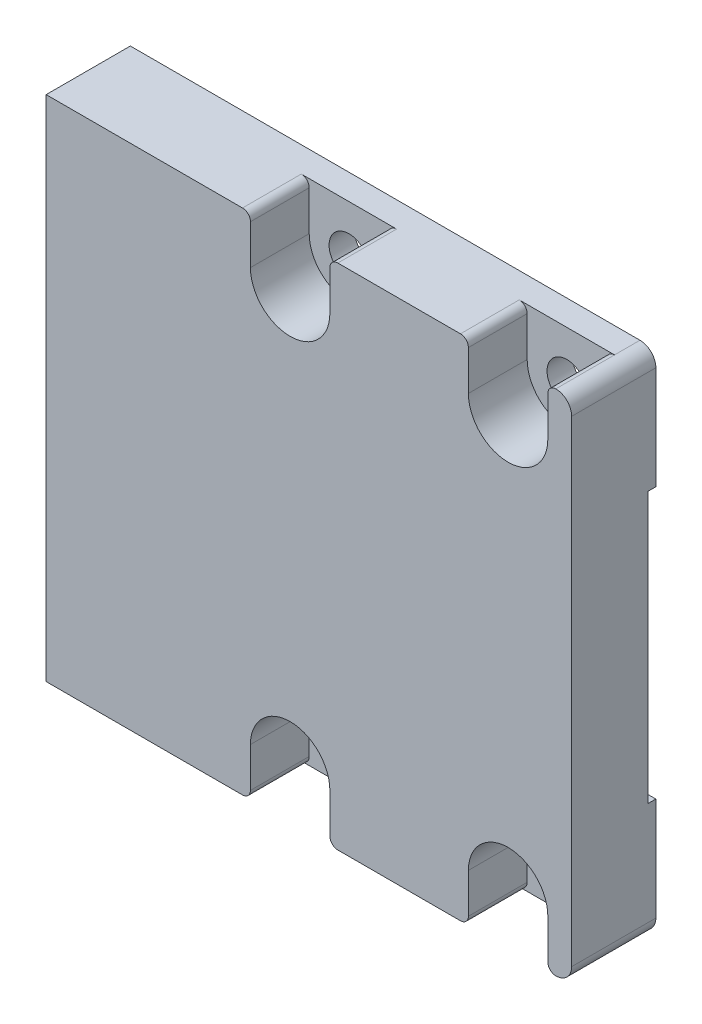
ISO-10303-21;
HEADER;
FILE_DESCRIPTION(('STEP AP214'),'2;1');
FILE_NAME('part.step','',(''),(''),'','','');
FILE_SCHEMA(('AUTOMOTIVE_DESIGN { 1 0 10303 214 1 1 1 1 }'));
ENDSEC;
DATA;
#1=APPLICATION_CONTEXT('core data for automotive mechanical design processes');
#2=APPLICATION_PROTOCOL_DEFINITION('international standard','automotive_design',2000,#1);
#3=PRODUCT_CONTEXT('',#1,'mechanical');
#4=PRODUCT('Part','Part','',(#3));
#5=PRODUCT_RELATED_PRODUCT_CATEGORY('part','',(#4));
#6=PRODUCT_DEFINITION_FORMATION('','',#4);
#7=PRODUCT_DEFINITION_CONTEXT('part definition',#1,'design');
#8=PRODUCT_DEFINITION('design','',#6,#7);
#9=PRODUCT_DEFINITION_SHAPE('','',#8);
#10=(LENGTH_UNIT() NAMED_UNIT(*) SI_UNIT(.MILLI.,.METRE.));
#11=(NAMED_UNIT(*) PLANE_ANGLE_UNIT() SI_UNIT($,.RADIAN.));
#12=(NAMED_UNIT(*) SI_UNIT($,.STERADIAN.) SOLID_ANGLE_UNIT());
#13=UNCERTAINTY_MEASURE_WITH_UNIT(LENGTH_MEASURE(1.E-05),#10,'distance_accuracy_value','');
#14=(GEOMETRIC_REPRESENTATION_CONTEXT(3) GLOBAL_UNCERTAINTY_ASSIGNED_CONTEXT((#13)) GLOBAL_UNIT_ASSIGNED_CONTEXT((#10,
#11,#12)) REPRESENTATION_CONTEXT('',''));
#15=CARTESIAN_POINT('',(0.,0.,0.));
#16=DIRECTION('',(0.,0.,1.));
#17=DIRECTION('',(1.,0.,0.));
#18=AXIS2_PLACEMENT_3D('',#15,#16,#17);
#19=CARTESIAN_POINT('',(23.4813134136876,4.80412632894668,51.5248454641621));
#20=DIRECTION('',(0.,0.,-1.));
#21=DIRECTION('',(-1.,0.,0.));
#22=AXIS2_PLACEMENT_3D('',#19,#20,#21);
#23=CYLINDRICAL_SURFACE('',#22,1.25);
#24=CARTESIAN_POINT('',(23.4813134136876,4.80412632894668,0.));
#25=DIRECTION('',(0.,0.,1.));
#26=DIRECTION('',(1.,0.,0.));
#27=AXIS2_PLACEMENT_3D('',#24,#25,#26);
#28=CIRCLE('',#27,1.25);
#29=CARTESIAN_POINT('',(24.7313134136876,4.80412632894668,0.));
#30=VERTEX_POINT('',#29);
#31=EDGE_CURVE('E405',#30,#30,#28,.T.);
#32=ORIENTED_EDGE('',*,*,#31,.F.);
#33=EDGE_LOOP('',(#32));
#34=FACE_BOUND('',#33,.T.);
#35=CARTESIAN_POINT('',(23.4813134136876,4.80412632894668,1.6));
#36=DIRECTION('',(0.,0.,1.));
#37=DIRECTION('',(1.,0.,0.));
#38=AXIS2_PLACEMENT_3D('',#35,#36,#37);
#39=CIRCLE('',#38,1.25);
#40=CARTESIAN_POINT('',(24.7313134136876,4.80412632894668,1.6));
#41=VERTEX_POINT('',#40);
#42=EDGE_CURVE('E356',#41,#41,#39,.T.);
#43=ORIENTED_EDGE('',*,*,#42,.T.);
#44=EDGE_LOOP('',(#43));
#45=FACE_BOUND('',#44,.T.);
#46=ADVANCED_FACE('F40',(#34,#45),#23,.F.);
#47=CARTESIAN_POINT('',(37.2013134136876,30.8041263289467,51.5248454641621));
#48=DIRECTION('',(0.,0.,-1.));
#49=DIRECTION('',(-1.,0.,0.));
#50=AXIS2_PLACEMENT_3D('',#47,#48,#49);
#51=CYLINDRICAL_SURFACE('',#50,1.25);
#52=CARTESIAN_POINT('',(37.2013134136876,30.8041263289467,0.));
#53=DIRECTION('',(0.,0.,1.));
#54=DIRECTION('',(1.,0.,0.));
#55=AXIS2_PLACEMENT_3D('',#52,#53,#54);
#56=CIRCLE('',#55,1.25);
#57=CARTESIAN_POINT('',(38.4513134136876,30.8041263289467,0.));
#58=VERTEX_POINT('',#57);
#59=EDGE_CURVE('E402',#58,#58,#56,.T.);
#60=ORIENTED_EDGE('',*,*,#59,.F.);
#61=EDGE_LOOP('',(#60));
#62=FACE_BOUND('',#61,.T.);
#63=CARTESIAN_POINT('',(37.2013134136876,30.8041263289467,1.6));
#64=DIRECTION('',(0.,0.,1.));
#65=DIRECTION('',(1.,0.,0.));
#66=AXIS2_PLACEMENT_3D('',#63,#64,#65);
#67=CIRCLE('',#66,1.25);
#68=CARTESIAN_POINT('',(38.4513134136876,30.8041263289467,1.6));
#69=VERTEX_POINT('',#68);
#70=EDGE_CURVE('E362',#69,#69,#67,.T.);
#71=ORIENTED_EDGE('',*,*,#70,.T.);
#72=EDGE_LOOP('',(#71));
#73=FACE_BOUND('',#72,.T.);
#74=ADVANCED_FACE('F583',(#62,#73),#51,.F.);
#75=CARTESIAN_POINT('',(37.2013134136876,4.80412632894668,51.5248454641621));
#76=DIRECTION('',(0.,0.,-1.));
#77=DIRECTION('',(-1.,0.,0.));
#78=AXIS2_PLACEMENT_3D('',#75,#76,#77);
#79=CYLINDRICAL_SURFACE('',#78,1.25);
#80=CARTESIAN_POINT('',(37.2013134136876,4.80412632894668,0.));
#81=DIRECTION('',(0.,0.,1.));
#82=DIRECTION('',(1.,0.,0.));
#83=AXIS2_PLACEMENT_3D('',#80,#81,#82);
#84=CIRCLE('',#83,1.25);
#85=CARTESIAN_POINT('',(38.4513134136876,4.80412632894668,0.));
#86=VERTEX_POINT('',#85);
#87=EDGE_CURVE('E399',#86,#86,#84,.T.);
#88=ORIENTED_EDGE('',*,*,#87,.F.);
#89=EDGE_LOOP('',(#88));
#90=FACE_BOUND('',#89,.T.);
#91=CARTESIAN_POINT('',(37.2013134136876,4.80412632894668,1.6));
#92=DIRECTION('',(0.,0.,1.));
#93=DIRECTION('',(1.,0.,0.));
#94=AXIS2_PLACEMENT_3D('',#91,#92,#93);
#95=CIRCLE('',#94,1.25);
#96=CARTESIAN_POINT('',(38.4513134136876,4.80412632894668,1.6));
#97=VERTEX_POINT('',#96);
#98=EDGE_CURVE('E359',#97,#97,#95,.T.);
#99=ORIENTED_EDGE('',*,*,#98,.T.);
#100=EDGE_LOOP('',(#99));
#101=FACE_BOUND('',#100,.T.);
#102=ADVANCED_FACE('F589',(#90,#101),#79,.F.);
#103=CARTESIAN_POINT('',(23.4813134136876,30.8041263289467,51.5248454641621));
#104=DIRECTION('',(0.,0.,-1.));
#105=DIRECTION('',(-1.,0.,0.));
#106=AXIS2_PLACEMENT_3D('',#103,#104,#105);
#107=CYLINDRICAL_SURFACE('',#106,1.25);
#108=CARTESIAN_POINT('',(23.4813134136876,30.8041263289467,0.));
#109=DIRECTION('',(0.,0.,1.));
#110=DIRECTION('',(1.,0.,0.));
#111=AXIS2_PLACEMENT_3D('',#108,#109,#110);
#112=CIRCLE('',#111,1.25);
#113=CARTESIAN_POINT('',(24.7313134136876,30.8041263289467,0.));
#114=VERTEX_POINT('',#113);
#115=EDGE_CURVE('E396',#114,#114,#112,.T.);
#116=ORIENTED_EDGE('',*,*,#115,.F.);
#117=EDGE_LOOP('',(#116));
#118=FACE_BOUND('',#117,.T.);
#119=CARTESIAN_POINT('',(23.4813134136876,30.8041263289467,1.6));
#120=DIRECTION('',(0.,0.,1.));
#121=DIRECTION('',(1.,0.,0.));
#122=AXIS2_PLACEMENT_3D('',#119,#120,#121);
#123=CIRCLE('',#122,1.25);
#124=CARTESIAN_POINT('',(24.7313134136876,30.8041263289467,1.6));
#125=VERTEX_POINT('',#124);
#126=EDGE_CURVE('E365',#125,#125,#123,.T.);
#127=ORIENTED_EDGE('',*,*,#126,.T.);
#128=EDGE_LOOP('',(#127));
#129=FACE_BOUND('',#128,.T.);
#130=ADVANCED_FACE('F599',(#118,#129),#107,.F.);
#131=CARTESIAN_POINT('',(0.,0.,0.));
#132=DIRECTION('',(0.,0.,1.));
#133=DIRECTION('',(1.,0.,0.));
#134=AXIS2_PLACEMENT_3D('',#131,#132,#133);
#135=PLANE('',#134);
#136=ORIENTED_EDGE('',*,*,#115,.T.);
#137=EDGE_LOOP('',(#136));
#138=FACE_BOUND('',#137,.T.);
#139=ORIENTED_EDGE('',*,*,#87,.T.);
#140=EDGE_LOOP('',(#139));
#141=FACE_BOUND('',#140,.T.);
#142=ORIENTED_EDGE('',*,*,#59,.T.);
#143=EDGE_LOOP('',(#142));
#144=FACE_BOUND('',#143,.T.);
#145=ORIENTED_EDGE('',*,*,#31,.T.);
#146=EDGE_LOOP('',(#145));
#147=FACE_BOUND('',#146,.T.);
#148=DIRECTION('',(1.,0.,0.));
#149=VECTOR('',#148,1.);
#150=CARTESIAN_POINT('',(41.2013134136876,26.3141263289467,0.));
#151=LINE('',#150,#149);
#152=CARTESIAN_POINT('',(30.7013134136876,26.3141263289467,0.));
#153=VERTEX_POINT('',#152);
#154=CARTESIAN_POINT('',(41.2013134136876,26.3141263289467,0.));
#155=VERTEX_POINT('',#154);
#156=EDGE_CURVE('E56',#153,#155,#151,.T.);
#157=ORIENTED_EDGE('',*,*,#156,.F.);
#158=DIRECTION('',(0.,-1.,0.));
#159=VECTOR('',#158,1.);
#160=CARTESIAN_POINT('',(30.7013134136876,0.,0.));
#161=LINE('',#160,#159);
#162=CARTESIAN_POINT('',(30.7013134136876,9.29412632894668,0.));
#163=VERTEX_POINT('',#162);
#164=EDGE_CURVE('E522',#153,#163,#161,.T.);
#165=ORIENTED_EDGE('',*,*,#164,.T.);
#166=DIRECTION('',(-1.,0.,0.));
#167=VECTOR('',#166,1.);
#168=CARTESIAN_POINT('',(41.2013134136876,9.29412632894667,0.));
#169=LINE('',#168,#167);
#170=CARTESIAN_POINT('',(41.2013134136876,9.29412632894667,0.));
#171=VERTEX_POINT('',#170);
#172=EDGE_CURVE('E63',#171,#163,#169,.T.);
#173=ORIENTED_EDGE('',*,*,#172,.F.);
#174=DIRECTION('',(0.,-1.,0.));
#175=VECTOR('',#174,1.);
#176=CARTESIAN_POINT('',(41.2013134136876,0.,0.));
#177=LINE('',#176,#175);
#178=CARTESIAN_POINT('',(41.2013134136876,2.80412632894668,0.));
#179=VERTEX_POINT('',#178);
#180=EDGE_CURVE('E413',#171,#179,#177,.T.);
#181=ORIENTED_EDGE('',*,*,#180,.T.);
#182=CARTESIAN_POINT('',(40.2013134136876,2.80412632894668,0.));
#183=DIRECTION('',(0.,0.,1.));
#184=DIRECTION('',(1.,0.,0.));
#185=AXIS2_PLACEMENT_3D('',#182,#183,#184);
#186=CIRCLE('',#185,1.);
#187=CARTESIAN_POINT('',(40.2013134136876,1.80412632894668,0.));
#188=VERTEX_POINT('',#187);
#189=EDGE_CURVE('E432',#179,#188,#186,.F.);
#190=ORIENTED_EDGE('',*,*,#189,.T.);
#191=DIRECTION('',(-1.,0.,0.));
#192=VECTOR('',#191,1.);
#193=CARTESIAN_POINT('',(0.,1.80412632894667,0.));
#194=LINE('',#193,#192);
#195=CARTESIAN_POINT('',(8.12131341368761,1.80412632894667,0.));
#196=VERTEX_POINT('',#195);
#197=EDGE_CURVE('E411',#188,#196,#194,.T.);
#198=ORIENTED_EDGE('',*,*,#197,.T.);
#199=DIRECTION('',(0.,1.,0.));
#200=VECTOR('',#199,1.);
#201=CARTESIAN_POINT('',(8.12131341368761,0.,0.));
#202=LINE('',#201,#200);
#203=CARTESIAN_POINT('',(8.12131341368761,33.8041263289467,0.));
#204=VERTEX_POINT('',#203);
#205=EDGE_CURVE('E408',#196,#204,#202,.T.);
#206=ORIENTED_EDGE('',*,*,#205,.T.);
#207=DIRECTION('',(1.,0.,0.));
#208=VECTOR('',#207,1.);
#209=CARTESIAN_POINT('',(0.,33.8041263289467,0.));
#210=LINE('',#209,#208);
#211=CARTESIAN_POINT('',(40.2013134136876,33.8041263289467,0.));
#212=VERTEX_POINT('',#211);
#213=EDGE_CURVE('E416',#204,#212,#210,.T.);
#214=ORIENTED_EDGE('',*,*,#213,.T.);
#215=CARTESIAN_POINT('',(40.2013134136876,32.8041263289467,0.));
#216=DIRECTION('',(0.,0.,1.));
#217=DIRECTION('',(1.,0.,0.));
#218=AXIS2_PLACEMENT_3D('',#215,#216,#217);
#219=CIRCLE('',#218,1.);
#220=CARTESIAN_POINT('',(41.2013134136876,32.8041263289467,0.));
#221=VERTEX_POINT('',#220);
#222=EDGE_CURVE('E434',#212,#221,#219,.F.);
#223=ORIENTED_EDGE('',*,*,#222,.T.);
#224=EDGE_CURVE('E414',#221,#155,#177,.T.);
#225=ORIENTED_EDGE('',*,*,#224,.T.);
#226=EDGE_LOOP('',(#157,#165,#173,#181,#190,#198,#206,#214,#223,#225));
#227=FACE_BOUND('',#226,.T.);
#228=ADVANCED_FACE('F531',(#138,#141,#144,#147,#227),#135,.F.);
#229=CARTESIAN_POINT('',(0.,33.8041263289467,51.5248454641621));
#230=DIRECTION('',(0.,1.,0.));
#231=DIRECTION('',(-1.,0.,0.));
#232=AXIS2_PLACEMENT_3D('',#229,#230,#231);
#233=PLANE('',#232);
#234=DIRECTION('',(1.,0.,0.));
#235=VECTOR('',#234,1.);
#236=CARTESIAN_POINT('',(0.,33.8041263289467,5.3));
#237=LINE('',#236,#235);
#238=CARTESIAN_POINT('',(26.4813134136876,33.8041263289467,5.3));
#239=VERTEX_POINT('',#238);
#240=CARTESIAN_POINT('',(34.2013134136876,33.8041263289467,5.3));
#241=VERTEX_POINT('',#240);
#242=EDGE_CURVE('E424',#239,#241,#237,.T.);
#243=ORIENTED_EDGE('',*,*,#242,.T.);
#244=DIRECTION('',(0.,0.,1.));
#245=VECTOR('',#244,1.);
#246=CARTESIAN_POINT('',(34.2013134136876,33.8041263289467,1.6));
#247=LINE('',#246,#245);
#248=CARTESIAN_POINT('',(34.2013134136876,33.8041263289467,1.6));
#249=VERTEX_POINT('',#248);
#250=EDGE_CURVE('E475',#241,#249,#247,.F.);
#251=ORIENTED_EDGE('',*,*,#250,.T.);
#252=DIRECTION('',(1.,0.,0.));
#253=VECTOR('',#252,1.);
#254=CARTESIAN_POINT('',(39.7013134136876,33.8041263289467,1.6));
#255=LINE('',#254,#253);
#256=CARTESIAN_POINT('',(40.2013134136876,33.8041263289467,1.6));
#257=VERTEX_POINT('',#256);
#258=EDGE_CURVE('E294',#249,#257,#255,.T.);
#259=ORIENTED_EDGE('',*,*,#258,.T.);
#260=DIRECTION('',(0.,0.,-1.));
#261=VECTOR('',#260,1.);
#262=CARTESIAN_POINT('',(40.2013134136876,33.8041263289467,51.5248454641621));
#263=LINE('',#262,#261);
#264=EDGE_CURVE('E428',#257,#212,#263,.T.);
#265=ORIENTED_EDGE('',*,*,#264,.T.);
#266=ORIENTED_EDGE('',*,*,#213,.F.);
#267=DIRECTION('',(0.,0.,-1.));
#268=VECTOR('',#267,1.);
#269=CARTESIAN_POINT('',(8.12131341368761,33.8041263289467,51.5248454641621));
#270=LINE('',#269,#268);
#271=CARTESIAN_POINT('',(8.12131341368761,33.8041263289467,5.3));
#272=VERTEX_POINT('',#271);
#273=EDGE_CURVE('E419',#272,#204,#270,.T.);
#274=ORIENTED_EDGE('',*,*,#273,.F.);
#275=CARTESIAN_POINT('',(20.4813134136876,33.8041263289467,5.3));
#276=VERTEX_POINT('',#275);
#277=EDGE_CURVE('E425',#272,#276,#237,.T.);
#278=ORIENTED_EDGE('',*,*,#277,.T.);
#279=DIRECTION('',(0.,0.,1.));
#280=VECTOR('',#279,1.);
#281=CARTESIAN_POINT('',(20.4813134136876,33.8041263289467,1.6));
#282=LINE('',#281,#280);
#283=CARTESIAN_POINT('',(20.4813134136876,33.8041263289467,1.6));
#284=VERTEX_POINT('',#283);
#285=EDGE_CURVE('E472',#276,#284,#282,.F.);
#286=ORIENTED_EDGE('',*,*,#285,.T.);
#287=DIRECTION('',(1.,0.,0.));
#288=VECTOR('',#287,1.);
#289=CARTESIAN_POINT('',(25.9813134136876,33.8041263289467,1.6));
#290=LINE('',#289,#288);
#291=CARTESIAN_POINT('',(26.4813134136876,33.8041263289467,1.6));
#292=VERTEX_POINT('',#291);
#293=EDGE_CURVE('E319',#284,#292,#290,.T.);
#294=ORIENTED_EDGE('',*,*,#293,.T.);
#295=DIRECTION('',(0.,0.,1.));
#296=VECTOR('',#295,1.);
#297=CARTESIAN_POINT('',(26.4813134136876,33.8041263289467,5.3));
#298=LINE('',#297,#296);
#299=EDGE_CURVE('E469',#292,#239,#298,.T.);
#300=ORIENTED_EDGE('',*,*,#299,.T.);
#301=EDGE_LOOP('',(#243,#251,#259,#265,#266,#274,#278,#286,#294,#300));
#302=FACE_BOUND('',#301,.T.);
#303=ADVANCED_FACE('F560',(#302),#233,.T.);
#304=CARTESIAN_POINT('',(41.2013134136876,0.,51.5248454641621));
#305=DIRECTION('',(1.,0.,0.));
#306=DIRECTION('',(0.,1.,0.));
#307=AXIS2_PLACEMENT_3D('',#304,#305,#306);
#308=PLANE('',#307);
#309=DIRECTION('',(0.,0.,-1.));
#310=VECTOR('',#309,1.);
#311=CARTESIAN_POINT('',(41.2013134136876,26.3141263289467,0.5));
#312=LINE('',#311,#310);
#313=CARTESIAN_POINT('',(41.2013134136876,26.3141263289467,0.5));
#314=VERTEX_POINT('',#313);
#315=EDGE_CURVE('E382',#314,#155,#312,.T.);
#316=ORIENTED_EDGE('',*,*,#315,.T.);
#317=ORIENTED_EDGE('',*,*,#224,.F.);
#318=DIRECTION('',(0.,0.,-1.));
#319=VECTOR('',#318,1.);
#320=CARTESIAN_POINT('',(41.2013134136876,32.8041263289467,51.5248454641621));
#321=LINE('',#320,#319);
#322=CARTESIAN_POINT('',(41.2013134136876,32.8041263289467,5.3));
#323=VERTEX_POINT('',#322);
#324=EDGE_CURVE('E439',#221,#323,#321,.F.);
#325=ORIENTED_EDGE('',*,*,#324,.T.);
#326=DIRECTION('',(0.,-1.,0.));
#327=VECTOR('',#326,1.);
#328=CARTESIAN_POINT('',(41.2013134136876,0.,5.3));
#329=LINE('',#328,#327);
#330=CARTESIAN_POINT('',(41.2013134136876,2.80412632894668,5.3));
#331=VERTEX_POINT('',#330);
#332=EDGE_CURVE('E385',#323,#331,#329,.T.);
#333=ORIENTED_EDGE('',*,*,#332,.T.);
#334=DIRECTION('',(0.,0.,-1.));
#335=VECTOR('',#334,1.);
#336=CARTESIAN_POINT('',(41.2013134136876,2.80412632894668,51.5248454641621));
#337=LINE('',#336,#335);
#338=EDGE_CURVE('E436',#331,#179,#337,.T.);
#339=ORIENTED_EDGE('',*,*,#338,.T.);
#340=ORIENTED_EDGE('',*,*,#180,.F.);
#341=DIRECTION('',(0.,0.,-1.));
#342=VECTOR('',#341,1.);
#343=CARTESIAN_POINT('',(41.2013134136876,9.29412632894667,0.5));
#344=LINE('',#343,#342);
#345=CARTESIAN_POINT('',(41.2013134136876,9.29412632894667,0.5));
#346=VERTEX_POINT('',#345);
#347=EDGE_CURVE('E379',#346,#171,#344,.T.);
#348=ORIENTED_EDGE('',*,*,#347,.F.);
#349=DIRECTION('',(0.,-1.,0.));
#350=VECTOR('',#349,1.);
#351=CARTESIAN_POINT('',(41.2013134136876,9.29412632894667,0.5));
#352=LINE('',#351,#350);
#353=EDGE_CURVE('E368',#314,#346,#352,.T.);
#354=ORIENTED_EDGE('',*,*,#353,.F.);
#355=EDGE_LOOP('',(#316,#317,#325,#333,#339,#340,#348,#354));
#356=FACE_BOUND('',#355,.T.);
#357=ADVANCED_FACE('F536',(#356),#308,.T.);
#358=CARTESIAN_POINT('',(0.,1.80412632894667,51.5248454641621));
#359=DIRECTION('',(0.,-1.,0.));
#360=DIRECTION('',(1.,0.,0.));
#361=AXIS2_PLACEMENT_3D('',#358,#359,#360);
#362=PLANE('',#361);
#363=DIRECTION('',(0.,0.,-1.));
#364=VECTOR('',#363,1.);
#365=CARTESIAN_POINT('',(40.2013134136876,1.80412632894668,51.5248454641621));
#366=LINE('',#365,#364);
#367=CARTESIAN_POINT('',(40.2013134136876,1.80412632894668,1.6));
#368=VERTEX_POINT('',#367);
#369=EDGE_CURVE('E447',#188,#368,#366,.F.);
#370=ORIENTED_EDGE('',*,*,#369,.T.);
#371=DIRECTION('',(-1.,0.,0.));
#372=VECTOR('',#371,1.);
#373=CARTESIAN_POINT('',(34.7013134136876,1.80412632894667,1.6));
#374=LINE('',#373,#372);
#375=CARTESIAN_POINT('',(34.2013134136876,1.80412632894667,1.6));
#376=VERTEX_POINT('',#375);
#377=EDGE_CURVE('E276',#368,#376,#374,.T.);
#378=ORIENTED_EDGE('',*,*,#377,.T.);
#379=DIRECTION('',(0.,0.,1.));
#380=VECTOR('',#379,1.);
#381=CARTESIAN_POINT('',(34.2013134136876,1.80412632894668,5.3));
#382=LINE('',#381,#380);
#383=CARTESIAN_POINT('',(34.2013134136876,1.80412632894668,5.3));
#384=VERTEX_POINT('',#383);
#385=EDGE_CURVE('E481',#376,#384,#382,.T.);
#386=ORIENTED_EDGE('',*,*,#385,.T.);
#387=DIRECTION('',(-1.,0.,0.));
#388=VECTOR('',#387,1.);
#389=CARTESIAN_POINT('',(0.,1.80412632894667,5.3));
#390=LINE('',#389,#388);
#391=CARTESIAN_POINT('',(26.4813134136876,1.80412632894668,5.3));
#392=VERTEX_POINT('',#391);
#393=EDGE_CURVE('E390',#384,#392,#390,.T.);
#394=ORIENTED_EDGE('',*,*,#393,.T.);
#395=DIRECTION('',(0.,0.,1.));
#396=VECTOR('',#395,1.);
#397=CARTESIAN_POINT('',(26.4813134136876,1.80412632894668,1.6));
#398=LINE('',#397,#396);
#399=CARTESIAN_POINT('',(26.4813134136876,1.80412632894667,1.6));
#400=VERTEX_POINT('',#399);
#401=EDGE_CURVE('E487',#392,#400,#398,.F.);
#402=ORIENTED_EDGE('',*,*,#401,.T.);
#403=DIRECTION('',(-1.,0.,0.));
#404=VECTOR('',#403,1.);
#405=CARTESIAN_POINT('',(20.9813134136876,1.80412632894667,1.6));
#406=LINE('',#405,#404);
#407=CARTESIAN_POINT('',(20.4813134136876,1.80412632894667,1.6));
#408=VERTEX_POINT('',#407);
#409=EDGE_CURVE('E335',#400,#408,#406,.T.);
#410=ORIENTED_EDGE('',*,*,#409,.T.);
#411=DIRECTION('',(0.,0.,1.));
#412=VECTOR('',#411,1.);
#413=CARTESIAN_POINT('',(20.4813134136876,1.80412632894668,5.3));
#414=LINE('',#413,#412);
#415=CARTESIAN_POINT('',(20.4813134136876,1.80412632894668,5.3));
#416=VERTEX_POINT('',#415);
#417=EDGE_CURVE('E484',#408,#416,#414,.T.);
#418=ORIENTED_EDGE('',*,*,#417,.T.);
#419=CARTESIAN_POINT('',(8.12131341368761,1.80412632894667,5.3));
#420=VERTEX_POINT('',#419);
#421=EDGE_CURVE('E389',#416,#420,#390,.T.);
#422=ORIENTED_EDGE('',*,*,#421,.T.);
#423=DIRECTION('',(0.,0.,-1.));
#424=VECTOR('',#423,1.);
#425=CARTESIAN_POINT('',(8.12131341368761,1.80412632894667,51.5248454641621));
#426=LINE('',#425,#424);
#427=EDGE_CURVE('E421',#420,#196,#426,.T.);
#428=ORIENTED_EDGE('',*,*,#427,.T.);
#429=ORIENTED_EDGE('',*,*,#197,.F.);
#430=EDGE_LOOP('',(#370,#378,#386,#394,#402,#410,#418,#422,#428,#429));
#431=FACE_BOUND('',#430,.T.);
#432=ADVANCED_FACE('F548',(#431),#362,.T.);
#433=CARTESIAN_POINT('',(8.12131341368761,0.,51.5248454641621));
#434=DIRECTION('',(-1.,0.,0.));
#435=DIRECTION('',(0.,0.,1.));
#436=AXIS2_PLACEMENT_3D('',#433,#434,#435);
#437=PLANE('',#436);
#438=ORIENTED_EDGE('',*,*,#427,.F.);
#439=DIRECTION('',(0.,1.,0.));
#440=VECTOR('',#439,1.);
#441=CARTESIAN_POINT('',(8.12131341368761,0.,5.3));
#442=LINE('',#441,#440);
#443=EDGE_CURVE('E393',#420,#272,#442,.T.);
#444=ORIENTED_EDGE('',*,*,#443,.T.);
#445=ORIENTED_EDGE('',*,*,#273,.T.);
#446=ORIENTED_EDGE('',*,*,#205,.F.);
#447=EDGE_LOOP('',(#438,#444,#445,#446));
#448=FACE_BOUND('',#447,.T.);
#449=ADVANCED_FACE('F555',(#448),#437,.T.);
#450=CARTESIAN_POINT('',(-8.51868658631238,17.8041263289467,5.3));
#451=DIRECTION('',(0.,0.,1.));
#452=DIRECTION('',(1.,0.,0.));
#453=AXIS2_PLACEMENT_3D('',#450,#451,#452);
#454=PLANE('',#453);
#455=DIRECTION('',(0.,-1.,0.));
#456=VECTOR('',#455,1.);
#457=CARTESIAN_POINT('',(34.7013134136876,33.8041263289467,5.3));
#458=LINE('',#457,#456);
#459=CARTESIAN_POINT('',(34.7013134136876,33.3041263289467,5.3));
#460=VERTEX_POINT('',#459);
#461=CARTESIAN_POINT('',(34.7013134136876,30.8041263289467,5.3));
#462=VERTEX_POINT('',#461);
#463=EDGE_CURVE('E307',#460,#462,#458,.T.);
#464=ORIENTED_EDGE('',*,*,#463,.F.);
#465=CARTESIAN_POINT('',(34.2013134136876,33.3041263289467,5.3));
#466=DIRECTION('',(0.,0.,1.));
#467=DIRECTION('',(1.,0.,0.));
#468=AXIS2_PLACEMENT_3D('',#465,#466,#467);
#469=CIRCLE('',#468,0.5);
#470=EDGE_CURVE('E467',#460,#241,#469,.T.);
#471=ORIENTED_EDGE('',*,*,#470,.T.);
#472=ORIENTED_EDGE('',*,*,#242,.F.);
#473=CARTESIAN_POINT('',(26.4813134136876,33.3041263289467,5.3));
#474=DIRECTION('',(0.,0.,1.));
#475=DIRECTION('',(1.,0.,0.));
#476=AXIS2_PLACEMENT_3D('',#473,#474,#475);
#477=CIRCLE('',#476,0.5);
#478=CARTESIAN_POINT('',(25.9813134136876,33.3041263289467,5.3));
#479=VERTEX_POINT('',#478);
#480=EDGE_CURVE('E455',#239,#479,#477,.T.);
#481=ORIENTED_EDGE('',*,*,#480,.T.);
#482=DIRECTION('',(0.,1.,0.));
#483=VECTOR('',#482,1.);
#484=CARTESIAN_POINT('',(25.9813134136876,30.8041263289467,5.3));
#485=LINE('',#484,#483);
#486=CARTESIAN_POINT('',(25.9813134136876,30.8041263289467,5.3));
#487=VERTEX_POINT('',#486);
#488=EDGE_CURVE('E326',#487,#479,#485,.T.);
#489=ORIENTED_EDGE('',*,*,#488,.F.);
#490=CARTESIAN_POINT('',(23.4813134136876,30.8041263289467,5.3));
#491=DIRECTION('',(0.,0.,1.));
#492=DIRECTION('',(1.,0.,0.));
#493=AXIS2_PLACEMENT_3D('',#490,#491,#492);
#494=CIRCLE('',#493,2.5);
#495=CARTESIAN_POINT('',(20.9813134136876,30.8041263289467,5.3));
#496=VERTEX_POINT('',#495);
#497=EDGE_CURVE('E323',#496,#487,#494,.T.);
#498=ORIENTED_EDGE('',*,*,#497,.F.);
#499=DIRECTION('',(0.,-1.,0.));
#500=VECTOR('',#499,1.);
#501=CARTESIAN_POINT('',(20.9813134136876,33.8041263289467,5.3));
#502=LINE('',#501,#500);
#503=CARTESIAN_POINT('',(20.9813134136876,33.3041263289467,5.3));
#504=VERTEX_POINT('',#503);
#505=EDGE_CURVE('E321',#504,#496,#502,.T.);
#506=ORIENTED_EDGE('',*,*,#505,.F.);
#507=CARTESIAN_POINT('',(20.4813134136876,33.3041263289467,5.3));
#508=DIRECTION('',(0.,0.,1.));
#509=DIRECTION('',(1.,0.,0.));
#510=AXIS2_PLACEMENT_3D('',#507,#508,#509);
#511=CIRCLE('',#510,0.5);
#512=EDGE_CURVE('E457',#504,#276,#511,.T.);
#513=ORIENTED_EDGE('',*,*,#512,.T.);
#514=ORIENTED_EDGE('',*,*,#277,.F.);
#515=ORIENTED_EDGE('',*,*,#443,.F.);
#516=ORIENTED_EDGE('',*,*,#421,.F.);
#517=CARTESIAN_POINT('',(20.4813134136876,2.30412632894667,5.3));
#518=DIRECTION('',(0.,0.,1.));
#519=DIRECTION('',(1.,0.,0.));
#520=AXIS2_PLACEMENT_3D('',#517,#518,#519);
#521=CIRCLE('',#520,0.5);
#522=CARTESIAN_POINT('',(20.9813134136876,2.30412632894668,5.3));
#523=VERTEX_POINT('',#522);
#524=EDGE_CURVE('E459',#416,#523,#521,.T.);
#525=ORIENTED_EDGE('',*,*,#524,.T.);
#526=DIRECTION('',(0.,-1.,0.));
#527=VECTOR('',#526,1.);
#528=CARTESIAN_POINT('',(20.9813134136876,4.80412632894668,5.3));
#529=LINE('',#528,#527);
#530=CARTESIAN_POINT('',(20.9813134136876,4.80412632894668,5.3));
#531=VERTEX_POINT('',#530);
#532=EDGE_CURVE('E345',#531,#523,#529,.T.);
#533=ORIENTED_EDGE('',*,*,#532,.F.);
#534=CARTESIAN_POINT('',(23.4813134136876,4.80412632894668,5.3));
#535=DIRECTION('',(0.,0.,1.));
#536=DIRECTION('',(1.,0.,0.));
#537=AXIS2_PLACEMENT_3D('',#534,#535,#536);
#538=CIRCLE('',#537,2.5);
#539=CARTESIAN_POINT('',(25.9813134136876,4.80412632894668,5.3));
#540=VERTEX_POINT('',#539);
#541=EDGE_CURVE('E293',#540,#531,#538,.T.);
#542=ORIENTED_EDGE('',*,*,#541,.F.);
#543=DIRECTION('',(0.,1.,0.));
#544=VECTOR('',#543,1.);
#545=CARTESIAN_POINT('',(25.9813134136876,1.80412632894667,5.3));
#546=LINE('',#545,#544);
#547=CARTESIAN_POINT('',(25.9813134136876,2.30412632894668,5.3));
#548=VERTEX_POINT('',#547);
#549=EDGE_CURVE('E348',#548,#540,#546,.T.);
#550=ORIENTED_EDGE('',*,*,#549,.F.);
#551=CARTESIAN_POINT('',(26.4813134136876,2.30412632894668,5.3));
#552=DIRECTION('',(0.,0.,1.));
#553=DIRECTION('',(1.,0.,0.));
#554=AXIS2_PLACEMENT_3D('',#551,#552,#553);
#555=CIRCLE('',#554,0.5);
#556=EDGE_CURVE('E461',#548,#392,#555,.T.);
#557=ORIENTED_EDGE('',*,*,#556,.T.);
#558=ORIENTED_EDGE('',*,*,#393,.F.);
#559=CARTESIAN_POINT('',(34.2013134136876,2.30412632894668,5.3));
#560=DIRECTION('',(0.,0.,1.));
#561=DIRECTION('',(1.,0.,0.));
#562=AXIS2_PLACEMENT_3D('',#559,#560,#561);
#563=CIRCLE('',#562,0.5);
#564=CARTESIAN_POINT('',(34.7013134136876,2.30412632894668,5.3));
#565=VERTEX_POINT('',#564);
#566=EDGE_CURVE('E453',#384,#565,#563,.T.);
#567=ORIENTED_EDGE('',*,*,#566,.T.);
#568=DIRECTION('',(0.,-1.,0.));
#569=VECTOR('',#568,1.);
#570=CARTESIAN_POINT('',(34.7013134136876,4.80412632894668,5.3));
#571=LINE('',#570,#569);
#572=CARTESIAN_POINT('',(34.7013134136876,4.80412632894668,5.3));
#573=VERTEX_POINT('',#572);
#574=EDGE_CURVE('E266',#573,#565,#571,.T.);
#575=ORIENTED_EDGE('',*,*,#574,.F.);
#576=CARTESIAN_POINT('',(37.2013134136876,4.80412632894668,5.3));
#577=DIRECTION('',(0.,0.,1.));
#578=DIRECTION('',(-1.,0.,0.));
#579=AXIS2_PLACEMENT_3D('',#576,#577,#578);
#580=CIRCLE('',#579,2.5);
#581=CARTESIAN_POINT('',(39.7013134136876,4.80412632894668,5.3));
#582=VERTEX_POINT('',#581);
#583=EDGE_CURVE('E271',#582,#573,#580,.T.);
#584=ORIENTED_EDGE('',*,*,#583,.F.);
#585=DIRECTION('',(0.,1.,0.));
#586=VECTOR('',#585,1.);
#587=CARTESIAN_POINT('',(39.7013134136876,1.80412632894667,5.3));
#588=LINE('',#587,#586);
#589=CARTESIAN_POINT('',(39.7013134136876,2.30412632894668,5.3));
#590=VERTEX_POINT('',#589);
#591=EDGE_CURVE('E256',#590,#582,#588,.T.);
#592=ORIENTED_EDGE('',*,*,#591,.F.);
#593=CARTESIAN_POINT('',(40.2013134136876,2.30412632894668,5.3));
#594=DIRECTION('',(0.,0.,1.));
#595=DIRECTION('',(1.,0.,0.));
#596=AXIS2_PLACEMENT_3D('',#593,#594,#595);
#597=CIRCLE('',#596,0.5);
#598=CARTESIAN_POINT('',(40.2013134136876,1.80412632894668,5.3));
#599=VERTEX_POINT('',#598);
#600=EDGE_CURVE('E463',#590,#599,#597,.T.);
#601=ORIENTED_EDGE('',*,*,#600,.T.);
#602=CARTESIAN_POINT('',(40.2013134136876,2.80412632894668,5.3));
#603=DIRECTION('',(0.,0.,1.));
#604=DIRECTION('',(1.,0.,0.));
#605=AXIS2_PLACEMENT_3D('',#602,#603,#604);
#606=CIRCLE('',#605,1.);
#607=EDGE_CURVE('E441',#599,#331,#606,.T.);
#608=ORIENTED_EDGE('',*,*,#607,.T.);
#609=ORIENTED_EDGE('',*,*,#332,.F.);
#610=CARTESIAN_POINT('',(40.2013134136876,32.8041263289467,5.3));
#611=DIRECTION('',(0.,0.,1.));
#612=DIRECTION('',(1.,0.,0.));
#613=AXIS2_PLACEMENT_3D('',#610,#611,#612);
#614=CIRCLE('',#613,1.);
#615=CARTESIAN_POINT('',(40.2013134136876,33.8041263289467,5.3));
#616=VERTEX_POINT('',#615);
#617=EDGE_CURVE('E443',#323,#616,#614,.T.);
#618=ORIENTED_EDGE('',*,*,#617,.T.);
#619=CARTESIAN_POINT('',(40.2013134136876,33.3041263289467,5.3));
#620=DIRECTION('',(0.,0.,1.));
#621=DIRECTION('',(1.,0.,0.));
#622=AXIS2_PLACEMENT_3D('',#619,#620,#621);
#623=CIRCLE('',#622,0.5);
#624=CARTESIAN_POINT('',(39.7013134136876,33.3041263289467,5.3));
#625=VERTEX_POINT('',#624);
#626=EDGE_CURVE('E465',#616,#625,#623,.T.);
#627=ORIENTED_EDGE('',*,*,#626,.T.);
#628=DIRECTION('',(0.,1.,0.));
#629=VECTOR('',#628,1.);
#630=CARTESIAN_POINT('',(39.7013134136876,30.8041263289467,5.3));
#631=LINE('',#630,#629);
#632=CARTESIAN_POINT('',(39.7013134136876,30.8041263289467,5.3));
#633=VERTEX_POINT('',#632);
#634=EDGE_CURVE('E303',#633,#625,#631,.T.);
#635=ORIENTED_EDGE('',*,*,#634,.F.);
#636=CARTESIAN_POINT('',(37.2013134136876,30.8041263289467,5.3));
#637=DIRECTION('',(0.,0.,1.));
#638=DIRECTION('',(1.,0.,0.));
#639=AXIS2_PLACEMENT_3D('',#636,#637,#638);
#640=CIRCLE('',#639,2.5);
#641=EDGE_CURVE('E301',#462,#633,#640,.T.);
#642=ORIENTED_EDGE('',*,*,#641,.F.);
#643=EDGE_LOOP('',(#464,#471,#472,#481,#489,#498,#506,#513,#514,#515,#516,#525,#533,#542,#550,
#557,#558,#567,#575,#584,#592,#601,#608,#609,#618,#627,#635,#642));
#644=FACE_BOUND('',#643,.T.);
#645=ADVANCED_FACE('F280',(#644),#454,.T.);
#646=CARTESIAN_POINT('',(40.2013134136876,32.8041263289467,51.5248454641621));
#647=DIRECTION('',(0.,0.,-1.));
#648=DIRECTION('',(-1.,0.,0.));
#649=AXIS2_PLACEMENT_3D('',#646,#647,#648);
#650=CYLINDRICAL_SURFACE('',#649,1.);
#651=ORIENTED_EDGE('',*,*,#617,.F.);
#652=ORIENTED_EDGE('',*,*,#324,.F.);
#653=ORIENTED_EDGE('',*,*,#222,.F.);
#654=ORIENTED_EDGE('',*,*,#264,.F.);
#655=EDGE_CURVE('E429',#616,#257,#263,.T.);
#656=ORIENTED_EDGE('',*,*,#655,.F.);
#657=EDGE_LOOP('',(#651,#652,#653,#654,#656));
#658=FACE_BOUND('',#657,.T.);
#659=ADVANCED_FACE('F567',(#658),#650,.T.);
#660=CARTESIAN_POINT('',(40.2013134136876,2.80412632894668,51.5248454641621));
#661=DIRECTION('',(0.,0.,-1.));
#662=DIRECTION('',(-1.,0.,0.));
#663=AXIS2_PLACEMENT_3D('',#660,#661,#662);
#664=CYLINDRICAL_SURFACE('',#663,1.);
#665=ORIENTED_EDGE('',*,*,#607,.F.);
#666=EDGE_CURVE('E446',#368,#599,#366,.F.);
#667=ORIENTED_EDGE('',*,*,#666,.F.);
#668=ORIENTED_EDGE('',*,*,#369,.F.);
#669=ORIENTED_EDGE('',*,*,#189,.F.);
#670=ORIENTED_EDGE('',*,*,#338,.F.);
#671=EDGE_LOOP('',(#665,#667,#668,#669,#670));
#672=FACE_BOUND('',#671,.T.);
#673=ADVANCED_FACE('F542',(#672),#664,.T.);
#674=CARTESIAN_POINT('',(41.2013134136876,26.3141263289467,0.5));
#675=DIRECTION('',(0.,1.,0.));
#676=DIRECTION('',(-1.,0.,0.));
#677=AXIS2_PLACEMENT_3D('',#674,#675,#676);
#678=PLANE('',#677);
#679=ORIENTED_EDGE('',*,*,#156,.T.);
#680=ORIENTED_EDGE('',*,*,#315,.F.);
#681=DIRECTION('',(1.,0.,0.));
#682=VECTOR('',#681,1.);
#683=CARTESIAN_POINT('',(41.2013134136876,26.3141263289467,0.5));
#684=LINE('',#683,#682);
#685=CARTESIAN_POINT('',(31.2013134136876,26.3141263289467,0.5));
#686=VERTEX_POINT('',#685);
#687=EDGE_CURVE('E377',#686,#314,#684,.T.);
#688=ORIENTED_EDGE('',*,*,#687,.F.);
#689=DIRECTION('',(0.707106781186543,0.,0.707106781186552));
#690=VECTOR('',#689,1.);
#691=CARTESIAN_POINT('',(36.2013134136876,26.3141263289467,5.5));
#692=LINE('',#691,#690);
#693=EDGE_CURVE('E49',#686,#153,#692,.F.);
#694=ORIENTED_EDGE('',*,*,#693,.T.);
#695=EDGE_LOOP('',(#679,#680,#688,#694));
#696=FACE_BOUND('',#695,.T.);
#697=ADVANCED_FACE('F526',(#696),#678,.F.);
#698=CARTESIAN_POINT('',(41.2013134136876,9.29412632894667,0.5));
#699=DIRECTION('',(0.,-1.,0.));
#700=DIRECTION('',(1.,0.,0.));
#701=AXIS2_PLACEMENT_3D('',#698,#699,#700);
#702=PLANE('',#701);
#703=ORIENTED_EDGE('',*,*,#172,.T.);
#704=DIRECTION('',(-0.707106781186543,0.,-0.707106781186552));
#705=VECTOR('',#704,1.);
#706=CARTESIAN_POINT('',(36.2013134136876,9.29412632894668,5.5));
#707=LINE('',#706,#705);
#708=CARTESIAN_POINT('',(31.2013134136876,9.29412632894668,0.5));
#709=VERTEX_POINT('',#708);
#710=EDGE_CURVE('E12',#163,#709,#707,.F.);
#711=ORIENTED_EDGE('',*,*,#710,.T.);
#712=DIRECTION('',(-1.,0.,0.));
#713=VECTOR('',#712,1.);
#714=CARTESIAN_POINT('',(41.2013134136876,9.29412632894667,0.5));
#715=LINE('',#714,#713);
#716=EDGE_CURVE('E371',#346,#709,#715,.T.);
#717=ORIENTED_EDGE('',*,*,#716,.F.);
#718=ORIENTED_EDGE('',*,*,#347,.T.);
#719=EDGE_LOOP('',(#703,#711,#717,#718));
#720=FACE_BOUND('',#719,.T.);
#721=ADVANCED_FACE('F571',(#720),#702,.F.);
#722=CARTESIAN_POINT('',(0.,0.,0.5));
#723=DIRECTION('',(0.,0.,1.));
#724=DIRECTION('',(1.,0.,0.));
#725=AXIS2_PLACEMENT_3D('',#722,#723,#724);
#726=PLANE('',#725);
#727=ORIENTED_EDGE('',*,*,#353,.T.);
#728=ORIENTED_EDGE('',*,*,#716,.T.);
#729=DIRECTION('',(0.,1.,0.));
#730=VECTOR('',#729,1.);
#731=CARTESIAN_POINT('',(31.2013134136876,9.29412632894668,0.5));
#732=LINE('',#731,#730);
#733=EDGE_CURVE('E374',#709,#686,#732,.T.);
#734=ORIENTED_EDGE('',*,*,#733,.T.);
#735=ORIENTED_EDGE('',*,*,#687,.T.);
#736=EDGE_LOOP('',(#727,#728,#734,#735));
#737=FACE_BOUND('',#736,.T.);
#738=ADVANCED_FACE('F570',(#737),#726,.F.);
#739=CARTESIAN_POINT('',(23.4813134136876,4.80412632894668,-7.43303437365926));
#740=DIRECTION('',(0.,0.,1.));
#741=DIRECTION('',(1.,0.,0.));
#742=AXIS2_PLACEMENT_3D('',#739,#740,#741);
#743=CYLINDRICAL_SURFACE('',#742,2.5);
#744=CARTESIAN_POINT('',(23.4813134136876,4.80412632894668,1.6));
#745=DIRECTION('',(0.,0.,1.));
#746=DIRECTION('',(1.,0.,0.));
#747=AXIS2_PLACEMENT_3D('',#744,#745,#746);
#748=CIRCLE('',#747,2.5);
#749=CARTESIAN_POINT('',(20.9813134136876,4.80412632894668,1.6));
#750=VERTEX_POINT('',#749);
#751=CARTESIAN_POINT('',(25.9813134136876,4.80412632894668,1.6));
#752=VERTEX_POINT('',#751);
#753=EDGE_CURVE('E341',#750,#752,#748,.F.);
#754=ORIENTED_EDGE('',*,*,#753,.T.);
#755=DIRECTION('',(0.,0.,1.));
#756=VECTOR('',#755,1.);
#757=CARTESIAN_POINT('',(25.9813134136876,4.80412632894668,-7.43303437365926));
#758=LINE('',#757,#756);
#759=EDGE_CURVE('E338',#752,#540,#758,.T.);
#760=ORIENTED_EDGE('',*,*,#759,.T.);
#761=ORIENTED_EDGE('',*,*,#541,.T.);
#762=DIRECTION('',(0.,0.,1.));
#763=VECTOR('',#762,1.);
#764=CARTESIAN_POINT('',(20.9813134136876,4.80412632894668,-7.43303437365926));
#765=LINE('',#764,#763);
#766=EDGE_CURVE('E350',#750,#531,#765,.T.);
#767=ORIENTED_EDGE('',*,*,#766,.F.);
#768=EDGE_LOOP('',(#754,#760,#761,#767));
#769=FACE_BOUND('',#768,.T.);
#770=ADVANCED_FACE('F578',(#769),#743,.F.);
#771=CARTESIAN_POINT('',(25.9813134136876,1.80412632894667,-7.43303437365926));
#772=DIRECTION('',(1.,0.,0.));
#773=DIRECTION('',(0.,0.,-1.));
#774=AXIS2_PLACEMENT_3D('',#771,#772,#773);
#775=PLANE('',#774);
#776=DIRECTION('',(0.,-1.,0.));
#777=VECTOR('',#776,1.);
#778=CARTESIAN_POINT('',(25.9813134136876,1.80412632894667,1.6));
#779=LINE('',#778,#777);
#780=CARTESIAN_POINT('',(25.9813134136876,2.30412632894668,1.6));
#781=VERTEX_POINT('',#780);
#782=EDGE_CURVE('E337',#752,#781,#779,.T.);
#783=ORIENTED_EDGE('',*,*,#782,.T.);
#784=DIRECTION('',(0.,0.,1.));
#785=VECTOR('',#784,1.);
#786=CARTESIAN_POINT('',(25.9813134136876,2.30412632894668,5.3));
#787=LINE('',#786,#785);
#788=EDGE_CURVE('E490',#781,#548,#787,.T.);
#789=ORIENTED_EDGE('',*,*,#788,.T.);
#790=ORIENTED_EDGE('',*,*,#549,.T.);
#791=ORIENTED_EDGE('',*,*,#759,.F.);
#792=EDGE_LOOP('',(#783,#789,#790,#791));
#793=FACE_BOUND('',#792,.T.);
#794=ADVANCED_FACE('F698',(#793),#775,.F.);
#795=CARTESIAN_POINT('',(20.9813134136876,4.80412632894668,-7.43303437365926));
#796=DIRECTION('',(-1.,0.,0.));
#797=DIRECTION('',(0.,-1.,0.));
#798=AXIS2_PLACEMENT_3D('',#795,#796,#797);
#799=PLANE('',#798);
#800=ORIENTED_EDGE('',*,*,#532,.T.);
#801=DIRECTION('',(0.,0.,1.));
#802=VECTOR('',#801,1.);
#803=CARTESIAN_POINT('',(20.9813134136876,2.30412632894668,1.6));
#804=LINE('',#803,#802);
#805=CARTESIAN_POINT('',(20.9813134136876,2.30412632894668,1.6));
#806=VERTEX_POINT('',#805);
#807=EDGE_CURVE('E493',#523,#806,#804,.F.);
#808=ORIENTED_EDGE('',*,*,#807,.T.);
#809=DIRECTION('',(0.,1.,0.));
#810=VECTOR('',#809,1.);
#811=CARTESIAN_POINT('',(20.9813134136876,4.80412632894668,1.6));
#812=LINE('',#811,#810);
#813=EDGE_CURVE('E343',#806,#750,#812,.T.);
#814=ORIENTED_EDGE('',*,*,#813,.T.);
#815=ORIENTED_EDGE('',*,*,#766,.T.);
#816=EDGE_LOOP('',(#800,#808,#814,#815));
#817=FACE_BOUND('',#816,.T.);
#818=ADVANCED_FACE('F696',(#817),#799,.F.);
#819=CARTESIAN_POINT('',(0.,0.,1.6));
#820=DIRECTION('',(0.,0.,1.));
#821=DIRECTION('',(1.,0.,0.));
#822=AXIS2_PLACEMENT_3D('',#819,#820,#821);
#823=PLANE('',#822);
#824=ORIENTED_EDGE('',*,*,#42,.F.);
#825=EDGE_LOOP('',(#824));
#826=FACE_BOUND('',#825,.T.);
#827=ORIENTED_EDGE('',*,*,#753,.F.);
#828=ORIENTED_EDGE('',*,*,#813,.F.);
#829=CARTESIAN_POINT('',(20.4813134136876,2.30412632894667,1.6));
#830=DIRECTION('',(0.,0.,1.));
#831=DIRECTION('',(1.,0.,0.));
#832=AXIS2_PLACEMENT_3D('',#829,#830,#831);
#833=CIRCLE('',#832,0.5);
#834=EDGE_CURVE('E511',#806,#408,#833,.F.);
#835=ORIENTED_EDGE('',*,*,#834,.T.);
#836=ORIENTED_EDGE('',*,*,#409,.F.);
#837=CARTESIAN_POINT('',(26.4813134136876,2.30412632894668,1.6));
#838=DIRECTION('',(0.,0.,1.));
#839=DIRECTION('',(1.,0.,0.));
#840=AXIS2_PLACEMENT_3D('',#837,#838,#839);
#841=CIRCLE('',#840,0.5);
#842=EDGE_CURVE('E509',#400,#781,#841,.F.);
#843=ORIENTED_EDGE('',*,*,#842,.T.);
#844=ORIENTED_EDGE('',*,*,#782,.F.);
#845=EDGE_LOOP('',(#827,#828,#835,#836,#843,#844));
#846=FACE_BOUND('',#845,.T.);
#847=ADVANCED_FACE('F663',(#826,#846),#823,.T.);
#848=CARTESIAN_POINT('',(37.2013134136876,4.80412632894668,-7.43303437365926));
#849=DIRECTION('',(0.,0.,1.));
#850=DIRECTION('',(1.,0.,0.));
#851=AXIS2_PLACEMENT_3D('',#848,#849,#850);
#852=CYLINDRICAL_SURFACE('',#851,2.5);
#853=CARTESIAN_POINT('',(37.2013134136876,4.80412632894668,1.6));
#854=DIRECTION('',(0.,0.,1.));
#855=DIRECTION('',(1.,0.,0.));
#856=AXIS2_PLACEMENT_3D('',#853,#854,#855);
#857=CIRCLE('',#856,2.5);
#858=CARTESIAN_POINT('',(34.7013134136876,4.80412632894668,1.6));
#859=VERTEX_POINT('',#858);
#860=CARTESIAN_POINT('',(39.7013134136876,4.80412632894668,1.6));
#861=VERTEX_POINT('',#860);
#862=EDGE_CURVE('E274',#859,#861,#857,.F.);
#863=ORIENTED_EDGE('',*,*,#862,.T.);
#864=DIRECTION('',(0.,0.,1.));
#865=VECTOR('',#864,1.);
#866=CARTESIAN_POINT('',(39.7013134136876,4.80412632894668,-7.43303437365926));
#867=LINE('',#866,#865);
#868=EDGE_CURVE('E260',#861,#582,#867,.T.);
#869=ORIENTED_EDGE('',*,*,#868,.T.);
#870=ORIENTED_EDGE('',*,*,#583,.T.);
#871=DIRECTION('',(0.,0.,1.));
#872=VECTOR('',#871,1.);
#873=CARTESIAN_POINT('',(34.7013134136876,4.80412632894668,-7.43303437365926));
#874=LINE('',#873,#872);
#875=EDGE_CURVE('E265',#859,#573,#874,.T.);
#876=ORIENTED_EDGE('',*,*,#875,.F.);
#877=EDGE_LOOP('',(#863,#869,#870,#876));
#878=FACE_BOUND('',#877,.T.);
#879=ADVANCED_FACE('F269',(#878),#852,.F.);
#880=CARTESIAN_POINT('',(39.7013134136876,1.80412632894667,-7.43303437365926));
#881=DIRECTION('',(1.,0.,0.));
#882=DIRECTION('',(0.,0.,-1.));
#883=AXIS2_PLACEMENT_3D('',#880,#881,#882);
#884=PLANE('',#883);
#885=DIRECTION('',(0.,-1.,0.));
#886=VECTOR('',#885,1.);
#887=CARTESIAN_POINT('',(39.7013134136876,1.80412632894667,1.6));
#888=LINE('',#887,#886);
#889=CARTESIAN_POINT('',(39.7013134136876,2.30412632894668,1.6));
#890=VERTEX_POINT('',#889);
#891=EDGE_CURVE('E753',#861,#890,#888,.T.);
#892=ORIENTED_EDGE('',*,*,#891,.T.);
#893=DIRECTION('',(0.,0.,1.));
#894=VECTOR('',#893,1.);
#895=CARTESIAN_POINT('',(39.7013134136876,2.30412632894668,5.3));
#896=LINE('',#895,#894);
#897=EDGE_CURVE('E262',#890,#590,#896,.T.);
#898=ORIENTED_EDGE('',*,*,#897,.T.);
#899=ORIENTED_EDGE('',*,*,#591,.T.);
#900=ORIENTED_EDGE('',*,*,#868,.F.);
#901=EDGE_LOOP('',(#892,#898,#899,#900));
#902=FACE_BOUND('',#901,.T.);
#903=ADVANCED_FACE('F259',(#902),#884,.F.);
#904=CARTESIAN_POINT('',(34.7013134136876,4.80412632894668,-7.43303437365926));
#905=DIRECTION('',(-1.,0.,0.));
#906=DIRECTION('',(0.,0.,1.));
#907=AXIS2_PLACEMENT_3D('',#904,#905,#906);
#908=PLANE('',#907);
#909=ORIENTED_EDGE('',*,*,#574,.T.);
#910=DIRECTION('',(0.,0.,1.));
#911=VECTOR('',#910,1.);
#912=CARTESIAN_POINT('',(34.7013134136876,2.30412632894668,1.6));
#913=LINE('',#912,#911);
#914=CARTESIAN_POINT('',(34.7013134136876,2.30412632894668,1.6));
#915=VERTEX_POINT('',#914);
#916=EDGE_CURVE('E500',#565,#915,#913,.F.);
#917=ORIENTED_EDGE('',*,*,#916,.T.);
#918=DIRECTION('',(0.,1.,0.));
#919=VECTOR('',#918,1.);
#920=CARTESIAN_POINT('',(34.7013134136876,4.80412632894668,1.6));
#921=LINE('',#920,#919);
#922=EDGE_CURVE('E291',#915,#859,#921,.T.);
#923=ORIENTED_EDGE('',*,*,#922,.T.);
#924=ORIENTED_EDGE('',*,*,#875,.T.);
#925=EDGE_LOOP('',(#909,#917,#923,#924));
#926=FACE_BOUND('',#925,.T.);
#927=ADVANCED_FACE('F649',(#926),#908,.F.);
#928=CARTESIAN_POINT('',(0.,0.,1.6));
#929=DIRECTION('',(0.,0.,1.));
#930=DIRECTION('',(1.,0.,0.));
#931=AXIS2_PLACEMENT_3D('',#928,#929,#930);
#932=PLANE('',#931);
#933=ORIENTED_EDGE('',*,*,#98,.F.);
#934=EDGE_LOOP('',(#933));
#935=FACE_BOUND('',#934,.T.);
#936=ORIENTED_EDGE('',*,*,#862,.F.);
#937=ORIENTED_EDGE('',*,*,#922,.F.);
#938=CARTESIAN_POINT('',(34.2013134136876,2.30412632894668,1.6));
#939=DIRECTION('',(0.,0.,1.));
#940=DIRECTION('',(1.,0.,0.));
#941=AXIS2_PLACEMENT_3D('',#938,#939,#940);
#942=CIRCLE('',#941,0.5);
#943=EDGE_CURVE('E519',#915,#376,#942,.F.);
#944=ORIENTED_EDGE('',*,*,#943,.T.);
#945=ORIENTED_EDGE('',*,*,#377,.F.);
#946=CARTESIAN_POINT('',(40.2013134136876,2.30412632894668,1.6));
#947=DIRECTION('',(0.,0.,1.));
#948=DIRECTION('',(1.,0.,0.));
#949=AXIS2_PLACEMENT_3D('',#946,#947,#948);
#950=CIRCLE('',#949,0.5);
#951=EDGE_CURVE('E507',#368,#890,#950,.F.);
#952=ORIENTED_EDGE('',*,*,#951,.T.);
#953=ORIENTED_EDGE('',*,*,#891,.F.);
#954=EDGE_LOOP('',(#936,#937,#944,#945,#952,#953));
#955=FACE_BOUND('',#954,.T.);
#956=ADVANCED_FACE('F647',(#935,#955),#932,.T.);
#957=CARTESIAN_POINT('',(37.2013134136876,30.8041263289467,-7.43303437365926));
#958=DIRECTION('',(0.,0.,1.));
#959=DIRECTION('',(1.,0.,0.));
#960=AXIS2_PLACEMENT_3D('',#957,#958,#959);
#961=CYLINDRICAL_SURFACE('',#960,2.5);
#962=CARTESIAN_POINT('',(37.2013134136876,30.8041263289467,1.6));
#963=DIRECTION('',(0.,0.,1.));
#964=DIRECTION('',(1.,0.,0.));
#965=AXIS2_PLACEMENT_3D('',#962,#963,#964);
#966=CIRCLE('',#965,2.5);
#967=CARTESIAN_POINT('',(39.7013134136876,30.8041263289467,1.6));
#968=VERTEX_POINT('',#967);
#969=CARTESIAN_POINT('',(34.7013134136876,30.8041263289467,1.6));
#970=VERTEX_POINT('',#969);
#971=EDGE_CURVE('E285',#968,#970,#966,.F.);
#972=ORIENTED_EDGE('',*,*,#971,.T.);
#973=DIRECTION('',(0.,0.,1.));
#974=VECTOR('',#973,1.);
#975=CARTESIAN_POINT('',(34.7013134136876,30.8041263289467,-7.43303437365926));
#976=LINE('',#975,#974);
#977=EDGE_CURVE('E297',#970,#462,#976,.T.);
#978=ORIENTED_EDGE('',*,*,#977,.T.);
#979=ORIENTED_EDGE('',*,*,#641,.T.);
#980=DIRECTION('',(0.,0.,1.));
#981=VECTOR('',#980,1.);
#982=CARTESIAN_POINT('',(39.7013134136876,30.8041263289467,-7.43303437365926));
#983=LINE('',#982,#981);
#984=EDGE_CURVE('E309',#968,#633,#983,.T.);
#985=ORIENTED_EDGE('',*,*,#984,.F.);
#986=EDGE_LOOP('',(#972,#978,#979,#985));
#987=FACE_BOUND('',#986,.T.);
#988=ADVANCED_FACE('F656',(#987),#961,.F.);
#989=CARTESIAN_POINT('',(34.7013134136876,33.8041263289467,-7.43303437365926));
#990=DIRECTION('',(-1.,0.,0.));
#991=DIRECTION('',(0.,0.,1.));
#992=AXIS2_PLACEMENT_3D('',#989,#990,#991);
#993=PLANE('',#992);
#994=DIRECTION('',(0.,1.,0.));
#995=VECTOR('',#994,1.);
#996=CARTESIAN_POINT('',(34.7013134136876,33.8041263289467,1.6));
#997=LINE('',#996,#995);
#998=CARTESIAN_POINT('',(34.7013134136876,33.3041263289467,1.6));
#999=VERTEX_POINT('',#998);
#1000=EDGE_CURVE('E296',#970,#999,#997,.T.);
#1001=ORIENTED_EDGE('',*,*,#1000,.T.);
#1002=DIRECTION('',(0.,0.,1.));
#1003=VECTOR('',#1002,1.);
#1004=CARTESIAN_POINT('',(34.7013134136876,33.3041263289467,5.3));
#1005=LINE('',#1004,#1003);
#1006=EDGE_CURVE('E450',#999,#460,#1005,.T.);
#1007=ORIENTED_EDGE('',*,*,#1006,.T.);
#1008=ORIENTED_EDGE('',*,*,#463,.T.);
#1009=ORIENTED_EDGE('',*,*,#977,.F.);
#1010=EDGE_LOOP('',(#1001,#1007,#1008,#1009));
#1011=FACE_BOUND('',#1010,.T.);
#1012=ADVANCED_FACE('F670',(#1011),#993,.F.);
#1013=CARTESIAN_POINT('',(39.7013134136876,30.8041263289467,-7.43303437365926));
#1014=DIRECTION('',(1.,0.,0.));
#1015=DIRECTION('',(0.,0.,-1.));
#1016=AXIS2_PLACEMENT_3D('',#1013,#1014,#1015);
#1017=PLANE('',#1016);
#1018=ORIENTED_EDGE('',*,*,#634,.T.);
#1019=DIRECTION('',(0.,0.,1.));
#1020=VECTOR('',#1019,1.);
#1021=CARTESIAN_POINT('',(39.7013134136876,33.3041263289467,1.6));
#1022=LINE('',#1021,#1020);
#1023=CARTESIAN_POINT('',(39.7013134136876,33.3041263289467,1.6));
#1024=VERTEX_POINT('',#1023);
#1025=EDGE_CURVE('E478',#625,#1024,#1022,.F.);
#1026=ORIENTED_EDGE('',*,*,#1025,.T.);
#1027=DIRECTION('',(0.,-1.,0.));
#1028=VECTOR('',#1027,1.);
#1029=CARTESIAN_POINT('',(39.7013134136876,30.8041263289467,1.6));
#1030=LINE('',#1029,#1028);
#1031=EDGE_CURVE('E282',#1024,#968,#1030,.T.);
#1032=ORIENTED_EDGE('',*,*,#1031,.T.);
#1033=ORIENTED_EDGE('',*,*,#984,.T.);
#1034=EDGE_LOOP('',(#1018,#1026,#1032,#1033));
#1035=FACE_BOUND('',#1034,.T.);
#1036=ADVANCED_FACE('F668',(#1035),#1017,.F.);
#1037=CARTESIAN_POINT('',(0.,0.,1.6));
#1038=DIRECTION('',(0.,0.,1.));
#1039=DIRECTION('',(1.,0.,0.));
#1040=AXIS2_PLACEMENT_3D('',#1037,#1038,#1039);
#1041=PLANE('',#1040);
#1042=ORIENTED_EDGE('',*,*,#70,.F.);
#1043=EDGE_LOOP('',(#1042));
#1044=FACE_BOUND('',#1043,.T.);
#1045=ORIENTED_EDGE('',*,*,#971,.F.);
#1046=ORIENTED_EDGE('',*,*,#1031,.F.);
#1047=CARTESIAN_POINT('',(40.2013134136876,33.3041263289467,1.6));
#1048=DIRECTION('',(0.,0.,1.));
#1049=DIRECTION('',(1.,0.,0.));
#1050=AXIS2_PLACEMENT_3D('',#1047,#1048,#1049);
#1051=CIRCLE('',#1050,0.5);
#1052=EDGE_CURVE('E504',#1024,#257,#1051,.F.);
#1053=ORIENTED_EDGE('',*,*,#1052,.T.);
#1054=ORIENTED_EDGE('',*,*,#258,.F.);
#1055=CARTESIAN_POINT('',(34.2013134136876,33.3041263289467,1.6));
#1056=DIRECTION('',(0.,0.,1.));
#1057=DIRECTION('',(1.,0.,0.));
#1058=AXIS2_PLACEMENT_3D('',#1055,#1056,#1057);
#1059=CIRCLE('',#1058,0.5);
#1060=EDGE_CURVE('E502',#249,#999,#1059,.F.);
#1061=ORIENTED_EDGE('',*,*,#1060,.T.);
#1062=ORIENTED_EDGE('',*,*,#1000,.F.);
#1063=EDGE_LOOP('',(#1045,#1046,#1053,#1054,#1061,#1062));
#1064=FACE_BOUND('',#1063,.T.);
#1065=ADVANCED_FACE('F664',(#1044,#1064),#1041,.T.);
#1066=CARTESIAN_POINT('',(25.9813134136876,30.8041263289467,-7.43303437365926));
#1067=DIRECTION('',(1.,0.,0.));
#1068=DIRECTION('',(0.,0.,-1.));
#1069=AXIS2_PLACEMENT_3D('',#1066,#1067,#1068);
#1070=PLANE('',#1069);
#1071=ORIENTED_EDGE('',*,*,#488,.T.);
#1072=DIRECTION('',(0.,0.,1.));
#1073=VECTOR('',#1072,1.);
#1074=CARTESIAN_POINT('',(25.9813134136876,33.3041263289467,1.6));
#1075=LINE('',#1074,#1073);
#1076=CARTESIAN_POINT('',(25.9813134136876,33.3041263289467,1.6));
#1077=VERTEX_POINT('',#1076);
#1078=EDGE_CURVE('E498',#479,#1077,#1075,.F.);
#1079=ORIENTED_EDGE('',*,*,#1078,.T.);
#1080=DIRECTION('',(0.,-1.,0.));
#1081=VECTOR('',#1080,1.);
#1082=CARTESIAN_POINT('',(25.9813134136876,30.8041263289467,1.6));
#1083=LINE('',#1082,#1081);
#1084=CARTESIAN_POINT('',(25.9813134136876,30.8041263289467,1.6));
#1085=VERTEX_POINT('',#1084);
#1086=EDGE_CURVE('E316',#1077,#1085,#1083,.T.);
#1087=ORIENTED_EDGE('',*,*,#1086,.T.);
#1088=DIRECTION('',(0.,0.,1.));
#1089=VECTOR('',#1088,1.);
#1090=CARTESIAN_POINT('',(25.9813134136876,30.8041263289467,-7.43303437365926));
#1091=LINE('',#1090,#1089);
#1092=EDGE_CURVE('E317',#1085,#487,#1091,.T.);
#1093=ORIENTED_EDGE('',*,*,#1092,.T.);
#1094=EDGE_LOOP('',(#1071,#1079,#1087,#1093));
#1095=FACE_BOUND('',#1094,.T.);
#1096=ADVANCED_FACE('F667',(#1095),#1070,.F.);
#1097=CARTESIAN_POINT('',(23.4813134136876,30.8041263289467,-7.43303437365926));
#1098=DIRECTION('',(0.,0.,1.));
#1099=DIRECTION('',(1.,0.,0.));
#1100=AXIS2_PLACEMENT_3D('',#1097,#1098,#1099);
#1101=CYLINDRICAL_SURFACE('',#1100,2.5);
#1102=CARTESIAN_POINT('',(23.4813134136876,30.8041263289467,1.6));
#1103=DIRECTION('',(0.,0.,1.));
#1104=DIRECTION('',(1.,0.,0.));
#1105=AXIS2_PLACEMENT_3D('',#1102,#1103,#1104);
#1106=CIRCLE('',#1105,2.5);
#1107=CARTESIAN_POINT('',(20.9813134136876,30.8041263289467,1.6));
#1108=VERTEX_POINT('',#1107);
#1109=EDGE_CURVE('E314',#1085,#1108,#1106,.F.);
#1110=ORIENTED_EDGE('',*,*,#1109,.T.);
#1111=DIRECTION('',(0.,0.,1.));
#1112=VECTOR('',#1111,1.);
#1113=CARTESIAN_POINT('',(20.9813134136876,30.8041263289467,-7.43303437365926));
#1114=LINE('',#1113,#1112);
#1115=EDGE_CURVE('E329',#1108,#496,#1114,.T.);
#1116=ORIENTED_EDGE('',*,*,#1115,.T.);
#1117=ORIENTED_EDGE('',*,*,#497,.T.);
#1118=ORIENTED_EDGE('',*,*,#1092,.F.);
#1119=EDGE_LOOP('',(#1110,#1116,#1117,#1118));
#1120=FACE_BOUND('',#1119,.T.);
#1121=ADVANCED_FACE('F686',(#1120),#1101,.F.);
#1122=CARTESIAN_POINT('',(20.9813134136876,33.8041263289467,-7.43303437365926));
#1123=DIRECTION('',(-1.,0.,0.));
#1124=DIRECTION('',(0.,-1.,0.));
#1125=AXIS2_PLACEMENT_3D('',#1122,#1123,#1124);
#1126=PLANE('',#1125);
#1127=DIRECTION('',(0.,1.,0.));
#1128=VECTOR('',#1127,1.);
#1129=CARTESIAN_POINT('',(20.9813134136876,33.8041263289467,1.6));
#1130=LINE('',#1129,#1128);
#1131=CARTESIAN_POINT('',(20.9813134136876,33.3041263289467,1.6));
#1132=VERTEX_POINT('',#1131);
#1133=EDGE_CURVE('E304',#1108,#1132,#1130,.T.);
#1134=ORIENTED_EDGE('',*,*,#1133,.T.);
#1135=DIRECTION('',(0.,0.,1.));
#1136=VECTOR('',#1135,1.);
#1137=CARTESIAN_POINT('',(20.9813134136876,33.3041263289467,5.3));
#1138=LINE('',#1137,#1136);
#1139=EDGE_CURVE('E495',#1132,#504,#1138,.T.);
#1140=ORIENTED_EDGE('',*,*,#1139,.T.);
#1141=ORIENTED_EDGE('',*,*,#505,.T.);
#1142=ORIENTED_EDGE('',*,*,#1115,.F.);
#1143=EDGE_LOOP('',(#1134,#1140,#1141,#1142));
#1144=FACE_BOUND('',#1143,.T.);
#1145=ADVANCED_FACE('F682',(#1144),#1126,.F.);
#1146=CARTESIAN_POINT('',(0.,0.,1.6));
#1147=DIRECTION('',(0.,0.,1.));
#1148=DIRECTION('',(1.,0.,0.));
#1149=AXIS2_PLACEMENT_3D('',#1146,#1147,#1148);
#1150=PLANE('',#1149);
#1151=ORIENTED_EDGE('',*,*,#126,.F.);
#1152=EDGE_LOOP('',(#1151));
#1153=FACE_BOUND('',#1152,.T.);
#1154=ORIENTED_EDGE('',*,*,#293,.F.);
#1155=CARTESIAN_POINT('',(20.4813134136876,33.3041263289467,1.6));
#1156=DIRECTION('',(0.,0.,1.));
#1157=DIRECTION('',(1.,0.,0.));
#1158=AXIS2_PLACEMENT_3D('',#1155,#1156,#1157);
#1159=CIRCLE('',#1158,0.5);
#1160=EDGE_CURVE('E514',#284,#1132,#1159,.F.);
#1161=ORIENTED_EDGE('',*,*,#1160,.T.);
#1162=ORIENTED_EDGE('',*,*,#1133,.F.);
#1163=ORIENTED_EDGE('',*,*,#1109,.F.);
#1164=ORIENTED_EDGE('',*,*,#1086,.F.);
#1165=CARTESIAN_POINT('',(26.4813134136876,33.3041263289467,1.6));
#1166=DIRECTION('',(0.,0.,1.));
#1167=DIRECTION('',(1.,0.,0.));
#1168=AXIS2_PLACEMENT_3D('',#1165,#1166,#1167);
#1169=CIRCLE('',#1168,0.5);
#1170=EDGE_CURVE('E516',#1077,#292,#1169,.F.);
#1171=ORIENTED_EDGE('',*,*,#1170,.T.);
#1172=EDGE_LOOP('',(#1154,#1161,#1162,#1163,#1164,#1171));
#1173=FACE_BOUND('',#1172,.T.);
#1174=ADVANCED_FACE('F612',(#1153,#1173),#1150,.T.);
#1175=CARTESIAN_POINT('',(34.2013134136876,33.3041263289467,-7.43303437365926));
#1176=DIRECTION('',(0.,0.,-1.));
#1177=DIRECTION('',(-1.,0.,0.));
#1178=AXIS2_PLACEMENT_3D('',#1175,#1176,#1177);
#1179=CYLINDRICAL_SURFACE('',#1178,0.5);
#1180=ORIENTED_EDGE('',*,*,#1060,.F.);
#1181=ORIENTED_EDGE('',*,*,#250,.F.);
#1182=ORIENTED_EDGE('',*,*,#470,.F.);
#1183=ORIENTED_EDGE('',*,*,#1006,.F.);
#1184=EDGE_LOOP('',(#1180,#1181,#1182,#1183));
#1185=FACE_BOUND('',#1184,.T.);
#1186=ADVANCED_FACE('F608',(#1185),#1179,.T.);
#1187=CARTESIAN_POINT('',(40.2013134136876,33.3041263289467,51.5248454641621));
#1188=DIRECTION('',(0.,0.,-1.));
#1189=DIRECTION('',(-1.,0.,0.));
#1190=AXIS2_PLACEMENT_3D('',#1187,#1188,#1189);
#1191=CYLINDRICAL_SURFACE('',#1190,0.5);
#1192=ORIENTED_EDGE('',*,*,#1052,.F.);
#1193=ORIENTED_EDGE('',*,*,#1025,.F.);
#1194=ORIENTED_EDGE('',*,*,#626,.F.);
#1195=ORIENTED_EDGE('',*,*,#655,.T.);
#1196=EDGE_LOOP('',(#1192,#1193,#1194,#1195));
#1197=FACE_BOUND('',#1196,.T.);
#1198=ADVANCED_FACE('F611',(#1197),#1191,.T.);
#1199=CARTESIAN_POINT('',(40.2013134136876,2.30412632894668,-7.43303437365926));
#1200=DIRECTION('',(0.,0.,-1.));
#1201=DIRECTION('',(-1.,0.,0.));
#1202=AXIS2_PLACEMENT_3D('',#1199,#1200,#1201);
#1203=CYLINDRICAL_SURFACE('',#1202,0.5);
#1204=ORIENTED_EDGE('',*,*,#951,.F.);
#1205=ORIENTED_EDGE('',*,*,#666,.T.);
#1206=ORIENTED_EDGE('',*,*,#600,.F.);
#1207=ORIENTED_EDGE('',*,*,#897,.F.);
#1208=EDGE_LOOP('',(#1204,#1205,#1206,#1207));
#1209=FACE_BOUND('',#1208,.T.);
#1210=ADVANCED_FACE('F616',(#1209),#1203,.T.);
#1211=CARTESIAN_POINT('',(26.4813134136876,2.30412632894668,-7.43303437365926));
#1212=DIRECTION('',(0.,0.,-1.));
#1213=DIRECTION('',(-1.,0.,0.));
#1214=AXIS2_PLACEMENT_3D('',#1211,#1212,#1213);
#1215=CYLINDRICAL_SURFACE('',#1214,0.5);
#1216=ORIENTED_EDGE('',*,*,#842,.F.);
#1217=ORIENTED_EDGE('',*,*,#401,.F.);
#1218=ORIENTED_EDGE('',*,*,#556,.F.);
#1219=ORIENTED_EDGE('',*,*,#788,.F.);
#1220=EDGE_LOOP('',(#1216,#1217,#1218,#1219));
#1221=FACE_BOUND('',#1220,.T.);
#1222=ADVANCED_FACE('F620',(#1221),#1215,.T.);
#1223=CARTESIAN_POINT('',(20.4813134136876,2.30412632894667,51.5248454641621));
#1224=DIRECTION('',(0.,0.,-1.));
#1225=DIRECTION('',(-1.,0.,0.));
#1226=AXIS2_PLACEMENT_3D('',#1223,#1224,#1225);
#1227=CYLINDRICAL_SURFACE('',#1226,0.5);
#1228=ORIENTED_EDGE('',*,*,#834,.F.);
#1229=ORIENTED_EDGE('',*,*,#807,.F.);
#1230=ORIENTED_EDGE('',*,*,#524,.F.);
#1231=ORIENTED_EDGE('',*,*,#417,.F.);
#1232=EDGE_LOOP('',(#1228,#1229,#1230,#1231));
#1233=FACE_BOUND('',#1232,.T.);
#1234=ADVANCED_FACE('F624',(#1233),#1227,.T.);
#1235=CARTESIAN_POINT('',(20.4813134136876,33.3041263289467,-7.43303437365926));
#1236=DIRECTION('',(0.,0.,-1.));
#1237=DIRECTION('',(-1.,0.,0.));
#1238=AXIS2_PLACEMENT_3D('',#1235,#1236,#1237);
#1239=CYLINDRICAL_SURFACE('',#1238,0.5);
#1240=ORIENTED_EDGE('',*,*,#1160,.F.);
#1241=ORIENTED_EDGE('',*,*,#285,.F.);
#1242=ORIENTED_EDGE('',*,*,#512,.F.);
#1243=ORIENTED_EDGE('',*,*,#1139,.F.);
#1244=EDGE_LOOP('',(#1240,#1241,#1242,#1243));
#1245=FACE_BOUND('',#1244,.T.);
#1246=ADVANCED_FACE('F628',(#1245),#1239,.T.);
#1247=CARTESIAN_POINT('',(26.4813134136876,33.3041263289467,51.5248454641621));
#1248=DIRECTION('',(0.,0.,-1.));
#1249=DIRECTION('',(-1.,0.,0.));
#1250=AXIS2_PLACEMENT_3D('',#1247,#1248,#1249);
#1251=CYLINDRICAL_SURFACE('',#1250,0.5);
#1252=ORIENTED_EDGE('',*,*,#1170,.F.);
#1253=ORIENTED_EDGE('',*,*,#1078,.F.);
#1254=ORIENTED_EDGE('',*,*,#480,.F.);
#1255=ORIENTED_EDGE('',*,*,#299,.F.);
#1256=EDGE_LOOP('',(#1252,#1253,#1254,#1255));
#1257=FACE_BOUND('',#1256,.T.);
#1258=ADVANCED_FACE('F632',(#1257),#1251,.T.);
#1259=CARTESIAN_POINT('',(34.2013134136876,2.30412632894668,51.5248454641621));
#1260=DIRECTION('',(0.,0.,-1.));
#1261=DIRECTION('',(-1.,0.,0.));
#1262=AXIS2_PLACEMENT_3D('',#1259,#1260,#1261);
#1263=CYLINDRICAL_SURFACE('',#1262,0.5);
#1264=ORIENTED_EDGE('',*,*,#943,.F.);
#1265=ORIENTED_EDGE('',*,*,#916,.F.);
#1266=ORIENTED_EDGE('',*,*,#566,.F.);
#1267=ORIENTED_EDGE('',*,*,#385,.F.);
#1268=EDGE_LOOP('',(#1264,#1265,#1266,#1267));
#1269=FACE_BOUND('',#1268,.T.);
#1270=ADVANCED_FACE('F635',(#1269),#1263,.T.);
#1271=CARTESIAN_POINT('',(31.2013134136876,9.29412632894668,0.5));
#1272=DIRECTION('',(-0.707106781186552,0.,0.707106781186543));
#1273=DIRECTION('',(0.,1.,0.));
#1274=AXIS2_PLACEMENT_3D('',#1271,#1272,#1273);
#1275=PLANE('',#1274);
#1276=ORIENTED_EDGE('',*,*,#710,.F.);
#1277=ORIENTED_EDGE('',*,*,#164,.F.);
#1278=ORIENTED_EDGE('',*,*,#693,.F.);
#1279=ORIENTED_EDGE('',*,*,#733,.F.);
#1280=EDGE_LOOP('',(#1276,#1277,#1278,#1279));
#1281=FACE_BOUND('',#1280,.T.);
#1282=ADVANCED_FACE('F43',(#1281),#1275,.F.);
#1283=CLOSED_SHELL('',(#46,#74,#102,#130,#228,#303,#357,#432,#449,#645,#659,#673,#697,#721,#738,
#770,#794,#818,#847,#879,#903,#927,#956,#988,#1012,#1036,#1065,#1096,#1121,#1145,#1174,#1186,
#1198,#1210,#1222,#1234,#1246,#1258,#1270,#1282));
#1284=MANIFOLD_SOLID_BREP('B2',#1283);
#1285=ADVANCED_BREP_SHAPE_REPRESENTATION('',(#18,#1284),#14);
#1286=SHAPE_DEFINITION_REPRESENTATION(#9,#1285);
ENDSEC;
END-ISO-10303-21;
